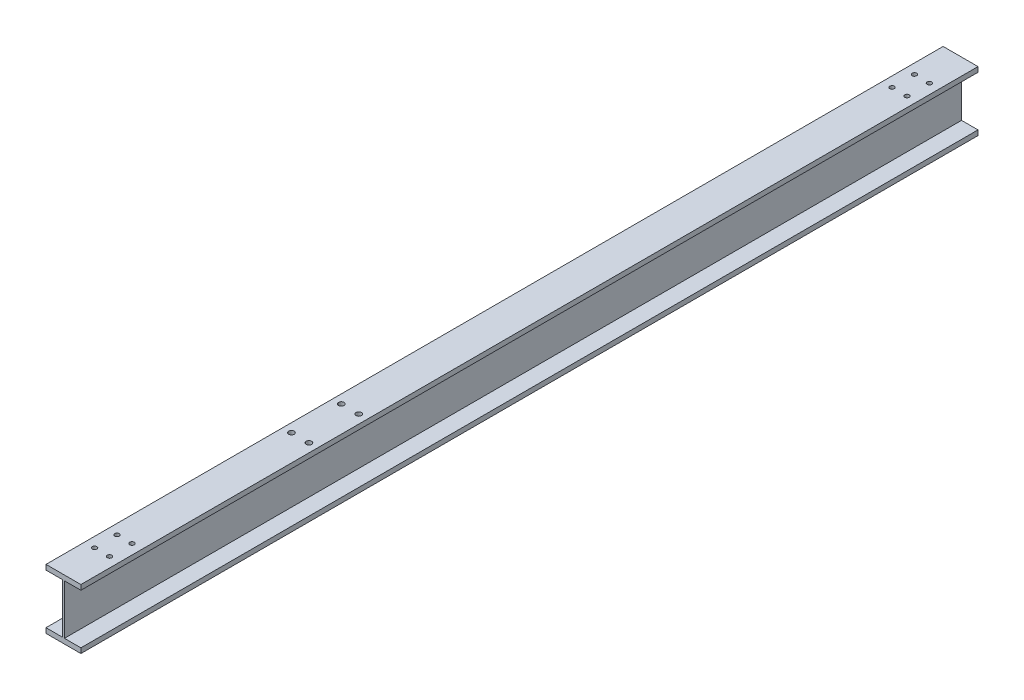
ISO-10303-21;
HEADER;
FILE_DESCRIPTION(('STEP AP214'),'2;1');
FILE_NAME('part.step','',(''),(''),'','','');
FILE_SCHEMA(('AUTOMOTIVE_DESIGN { 1 0 10303 214 1 1 1 1 }'));
ENDSEC;
DATA;
#1=APPLICATION_CONTEXT('core data for automotive mechanical design processes');
#2=APPLICATION_PROTOCOL_DEFINITION('international standard','automotive_design',2000,#1);
#3=PRODUCT_CONTEXT('',#1,'mechanical');
#4=PRODUCT('Part','Part','',(#3));
#5=PRODUCT_RELATED_PRODUCT_CATEGORY('part','',(#4));
#6=PRODUCT_DEFINITION_FORMATION('','',#4);
#7=PRODUCT_DEFINITION_CONTEXT('part definition',#1,'design');
#8=PRODUCT_DEFINITION('design','',#6,#7);
#9=PRODUCT_DEFINITION_SHAPE('','',#8);
#10=(LENGTH_UNIT() NAMED_UNIT(*) SI_UNIT(.MILLI.,.METRE.));
#11=(NAMED_UNIT(*) PLANE_ANGLE_UNIT() SI_UNIT($,.RADIAN.));
#12=(NAMED_UNIT(*) SI_UNIT($,.STERADIAN.) SOLID_ANGLE_UNIT());
#13=UNCERTAINTY_MEASURE_WITH_UNIT(LENGTH_MEASURE(1.E-05),#10,'distance_accuracy_value','');
#14=(GEOMETRIC_REPRESENTATION_CONTEXT(3) GLOBAL_UNCERTAINTY_ASSIGNED_CONTEXT((#13)) GLOBAL_UNIT_ASSIGNED_CONTEXT((#10,
#11,#12)) REPRESENTATION_CONTEXT('',''));
#15=CARTESIAN_POINT('',(0.,0.,0.));
#16=DIRECTION('',(0.,0.,1.));
#17=DIRECTION('',(1.,0.,0.));
#18=AXIS2_PLACEMENT_3D('',#15,#16,#17);
#19=CARTESIAN_POINT('',(-30.,95.,155.));
#20=DIRECTION('',(0.,1.,0.));
#21=DIRECTION('',(0.,0.,1.));
#22=AXIS2_PLACEMENT_3D('',#19,#20,#21);
#23=CYLINDRICAL_SURFACE('',#22,9.);
#24=DIRECTION('',(0.,1.,0.));
#25=VECTOR('',#24,1.);
#26=CARTESIAN_POINT('',(-30.,95.,164.));
#27=LINE('',#26,#25);
#28=CARTESIAN_POINT('',(-30.,100.,164.));
#29=VERTEX_POINT('',#28);
#30=CARTESIAN_POINT('',(-30.,120.,164.));
#31=VERTEX_POINT('',#30);
#32=EDGE_CURVE('E10',#29,#31,#27,.T.);
#33=ORIENTED_EDGE('',*,*,#32,.F.);
#34=CARTESIAN_POINT('',(-30.,100.,155.));
#35=DIRECTION('',(0.,1.,0.));
#36=DIRECTION('',(0.,0.,1.));
#37=AXIS2_PLACEMENT_3D('',#34,#35,#36);
#38=CIRCLE('',#37,9.);
#39=EDGE_CURVE('E380',#29,#29,#38,.T.);
#40=ORIENTED_EDGE('',*,*,#39,.F.);
#41=ORIENTED_EDGE('',*,*,#32,.T.);
#42=CARTESIAN_POINT('',(-30.,120.,155.));
#43=DIRECTION('',(0.,1.,0.));
#44=DIRECTION('',(0.,0.,1.));
#45=AXIS2_PLACEMENT_3D('',#42,#43,#44);
#46=CIRCLE('',#45,9.);
#47=EDGE_CURVE('E461',#31,#31,#46,.T.);
#48=ORIENTED_EDGE('',*,*,#47,.T.);
#49=EDGE_LOOP('',(#33,#40,#41,#48));
#50=FACE_BOUND('',#49,.T.);
#51=ADVANCED_FACE('F16',(#50),#23,.F.);
#52=CARTESIAN_POINT('',(-30.,95.,245.));
#53=DIRECTION('',(0.,1.,0.));
#54=DIRECTION('',(0.,0.,1.));
#55=AXIS2_PLACEMENT_3D('',#52,#53,#54);
#56=CYLINDRICAL_SURFACE('',#55,9.);
#57=DIRECTION('',(0.,1.,0.));
#58=VECTOR('',#57,1.);
#59=CARTESIAN_POINT('',(-30.,95.,254.));
#60=LINE('',#59,#58);
#61=CARTESIAN_POINT('',(-30.,100.,254.));
#62=VERTEX_POINT('',#61);
#63=CARTESIAN_POINT('',(-30.,120.,254.));
#64=VERTEX_POINT('',#63);
#65=EDGE_CURVE('E25',#62,#64,#60,.T.);
#66=ORIENTED_EDGE('',*,*,#65,.F.);
#67=CARTESIAN_POINT('',(-30.,100.,245.));
#68=DIRECTION('',(0.,1.,0.));
#69=DIRECTION('',(0.,0.,1.));
#70=AXIS2_PLACEMENT_3D('',#67,#68,#69);
#71=CIRCLE('',#70,9.);
#72=EDGE_CURVE('E414',#62,#62,#71,.T.);
#73=ORIENTED_EDGE('',*,*,#72,.F.);
#74=ORIENTED_EDGE('',*,*,#65,.T.);
#75=CARTESIAN_POINT('',(-30.,120.,245.));
#76=DIRECTION('',(0.,1.,0.));
#77=DIRECTION('',(0.,0.,1.));
#78=AXIS2_PLACEMENT_3D('',#75,#76,#77);
#79=CIRCLE('',#78,9.);
#80=EDGE_CURVE('E285',#64,#64,#79,.T.);
#81=ORIENTED_EDGE('',*,*,#80,.T.);
#82=EDGE_LOOP('',(#66,#73,#74,#81));
#83=FACE_BOUND('',#82,.T.);
#84=ADVANCED_FACE('F596',(#83),#56,.F.);
#85=CARTESIAN_POINT('',(-35.,99.,2450.));
#86=DIRECTION('',(0.,1.,0.));
#87=DIRECTION('',(0.,0.,1.));
#88=AXIS2_PLACEMENT_3D('',#85,#86,#87);
#89=CYLINDRICAL_SURFACE('',#88,11.);
#90=DIRECTION('',(0.,1.,0.));
#91=VECTOR('',#90,1.);
#92=CARTESIAN_POINT('',(-35.,99.,2461.));
#93=LINE('',#92,#91);
#94=CARTESIAN_POINT('',(-35.,100.,2461.));
#95=VERTEX_POINT('',#94);
#96=CARTESIAN_POINT('',(-35.,120.,2461.));
#97=VERTEX_POINT('',#96);
#98=EDGE_CURVE('E19',#95,#97,#93,.T.);
#99=ORIENTED_EDGE('',*,*,#98,.F.);
#100=CARTESIAN_POINT('',(-35.,100.,2450.));
#101=DIRECTION('',(0.,1.,0.));
#102=DIRECTION('',(0.,0.,1.));
#103=AXIS2_PLACEMENT_3D('',#100,#101,#102);
#104=CIRCLE('',#103,11.);
#105=EDGE_CURVE('E474',#95,#95,#104,.T.);
#106=ORIENTED_EDGE('',*,*,#105,.F.);
#107=ORIENTED_EDGE('',*,*,#98,.T.);
#108=CARTESIAN_POINT('',(-35.,120.,2450.));
#109=DIRECTION('',(0.,1.,0.));
#110=DIRECTION('',(0.,0.,1.));
#111=AXIS2_PLACEMENT_3D('',#108,#109,#110);
#112=CIRCLE('',#111,11.);
#113=EDGE_CURVE('E337',#97,#97,#112,.T.);
#114=ORIENTED_EDGE('',*,*,#113,.T.);
#115=EDGE_LOOP('',(#99,#106,#107,#114));
#116=FACE_BOUND('',#115,.T.);
#117=ADVANCED_FACE('F600',(#116),#89,.F.);
#118=CARTESIAN_POINT('',(-35.,99.,2650.));
#119=DIRECTION('',(0.,1.,0.));
#120=DIRECTION('',(0.,0.,1.));
#121=AXIS2_PLACEMENT_3D('',#118,#119,#120);
#122=CYLINDRICAL_SURFACE('',#121,11.);
#123=DIRECTION('',(0.,1.,0.));
#124=VECTOR('',#123,1.);
#125=CARTESIAN_POINT('',(-35.,99.,2661.));
#126=LINE('',#125,#124);
#127=CARTESIAN_POINT('',(-35.,100.,2661.));
#128=VERTEX_POINT('',#127);
#129=CARTESIAN_POINT('',(-35.,120.,2661.));
#130=VERTEX_POINT('',#129);
#131=EDGE_CURVE('E385',#128,#130,#126,.T.);
#132=ORIENTED_EDGE('',*,*,#131,.F.);
#133=CARTESIAN_POINT('',(-35.,100.,2650.));
#134=DIRECTION('',(0.,1.,0.));
#135=DIRECTION('',(0.,0.,1.));
#136=AXIS2_PLACEMENT_3D('',#133,#134,#135);
#137=CIRCLE('',#136,11.);
#138=EDGE_CURVE('E470',#128,#128,#137,.T.);
#139=ORIENTED_EDGE('',*,*,#138,.F.);
#140=ORIENTED_EDGE('',*,*,#131,.T.);
#141=CARTESIAN_POINT('',(-35.,120.,2650.));
#142=DIRECTION('',(0.,1.,0.));
#143=DIRECTION('',(0.,0.,1.));
#144=AXIS2_PLACEMENT_3D('',#141,#142,#143);
#145=CIRCLE('',#144,11.);
#146=EDGE_CURVE('E333',#130,#130,#145,.T.);
#147=ORIENTED_EDGE('',*,*,#146,.T.);
#148=EDGE_LOOP('',(#132,#139,#140,#147));
#149=FACE_BOUND('',#148,.T.);
#150=ADVANCED_FACE('F604',(#149),#122,.F.);
#151=CARTESIAN_POINT('',(-30.,95.,3355.));
#152=DIRECTION('',(0.,1.,0.));
#153=DIRECTION('',(0.,0.,1.));
#154=AXIS2_PLACEMENT_3D('',#151,#152,#153);
#155=CYLINDRICAL_SURFACE('',#154,9.);
#156=DIRECTION('',(0.,1.,0.));
#157=VECTOR('',#156,1.);
#158=CARTESIAN_POINT('',(-30.,95.,3364.));
#159=LINE('',#158,#157);
#160=CARTESIAN_POINT('',(-30.,100.,3364.));
#161=VERTEX_POINT('',#160);
#162=CARTESIAN_POINT('',(-30.,120.,3364.));
#163=VERTEX_POINT('',#162);
#164=EDGE_CURVE('E327',#161,#163,#159,.T.);
#165=ORIENTED_EDGE('',*,*,#164,.F.);
#166=CARTESIAN_POINT('',(-30.,100.,3355.));
#167=DIRECTION('',(0.,1.,0.));
#168=DIRECTION('',(0.,0.,1.));
#169=AXIS2_PLACEMENT_3D('',#166,#167,#168);
#170=CIRCLE('',#169,9.);
#171=EDGE_CURVE('E410',#161,#161,#170,.T.);
#172=ORIENTED_EDGE('',*,*,#171,.F.);
#173=ORIENTED_EDGE('',*,*,#164,.T.);
#174=CARTESIAN_POINT('',(-30.,120.,3355.));
#175=DIRECTION('',(0.,1.,0.));
#176=DIRECTION('',(0.,0.,1.));
#177=AXIS2_PLACEMENT_3D('',#174,#175,#176);
#178=CIRCLE('',#177,9.);
#179=EDGE_CURVE('E338',#163,#163,#178,.T.);
#180=ORIENTED_EDGE('',*,*,#179,.T.);
#181=EDGE_LOOP('',(#165,#172,#173,#180));
#182=FACE_BOUND('',#181,.T.);
#183=ADVANCED_FACE('F497',(#182),#155,.F.);
#184=CARTESIAN_POINT('',(-30.,95.,3445.));
#185=DIRECTION('',(0.,1.,0.));
#186=DIRECTION('',(0.,0.,1.));
#187=AXIS2_PLACEMENT_3D('',#184,#185,#186);
#188=CYLINDRICAL_SURFACE('',#187,9.);
#189=DIRECTION('',(0.,1.,0.));
#190=VECTOR('',#189,1.);
#191=CARTESIAN_POINT('',(-30.,95.,3454.));
#192=LINE('',#191,#190);
#193=CARTESIAN_POINT('',(-30.,100.,3454.));
#194=VERTEX_POINT('',#193);
#195=CARTESIAN_POINT('',(-30.,120.,3454.));
#196=VERTEX_POINT('',#195);
#197=EDGE_CURVE('E324',#194,#196,#192,.T.);
#198=ORIENTED_EDGE('',*,*,#197,.F.);
#199=CARTESIAN_POINT('',(-30.,100.,3445.));
#200=DIRECTION('',(0.,1.,0.));
#201=DIRECTION('',(0.,0.,1.));
#202=AXIS2_PLACEMENT_3D('',#199,#200,#201);
#203=CIRCLE('',#202,9.);
#204=EDGE_CURVE('E415',#194,#194,#203,.T.);
#205=ORIENTED_EDGE('',*,*,#204,.F.);
#206=ORIENTED_EDGE('',*,*,#197,.T.);
#207=CARTESIAN_POINT('',(-30.,120.,3445.));
#208=DIRECTION('',(0.,1.,0.));
#209=DIRECTION('',(0.,0.,1.));
#210=AXIS2_PLACEMENT_3D('',#207,#208,#209);
#211=CIRCLE('',#210,9.);
#212=EDGE_CURVE('E441',#196,#196,#211,.T.);
#213=ORIENTED_EDGE('',*,*,#212,.T.);
#214=EDGE_LOOP('',(#198,#205,#206,#213));
#215=FACE_BOUND('',#214,.T.);
#216=ADVANCED_FACE('F613',(#215),#188,.F.);
#217=CARTESIAN_POINT('',(30.,95.,155.));
#218=DIRECTION('',(0.,1.,0.));
#219=DIRECTION('',(0.,0.,1.));
#220=AXIS2_PLACEMENT_3D('',#217,#218,#219);
#221=CYLINDRICAL_SURFACE('',#220,9.);
#222=DIRECTION('',(0.,1.,0.));
#223=VECTOR('',#222,1.);
#224=CARTESIAN_POINT('',(30.,95.,164.));
#225=LINE('',#224,#223);
#226=CARTESIAN_POINT('',(30.,100.,164.));
#227=VERTEX_POINT('',#226);
#228=CARTESIAN_POINT('',(30.,120.,164.));
#229=VERTEX_POINT('',#228);
#230=EDGE_CURVE('E328',#227,#229,#225,.T.);
#231=ORIENTED_EDGE('',*,*,#230,.F.);
#232=CARTESIAN_POINT('',(30.,100.,155.));
#233=DIRECTION('',(0.,1.,0.));
#234=DIRECTION('',(0.,0.,1.));
#235=AXIS2_PLACEMENT_3D('',#232,#233,#234);
#236=CIRCLE('',#235,9.);
#237=EDGE_CURVE('E371',#227,#227,#236,.T.);
#238=ORIENTED_EDGE('',*,*,#237,.F.);
#239=ORIENTED_EDGE('',*,*,#230,.T.);
#240=CARTESIAN_POINT('',(30.,120.,155.));
#241=DIRECTION('',(0.,1.,0.));
#242=DIRECTION('',(0.,0.,1.));
#243=AXIS2_PLACEMENT_3D('',#240,#241,#242);
#244=CIRCLE('',#243,9.);
#245=EDGE_CURVE('E281',#229,#229,#244,.T.);
#246=ORIENTED_EDGE('',*,*,#245,.T.);
#247=EDGE_LOOP('',(#231,#238,#239,#246));
#248=FACE_BOUND('',#247,.T.);
#249=ADVANCED_FACE('F616',(#248),#221,.F.);
#250=CARTESIAN_POINT('',(30.,95.,245.));
#251=DIRECTION('',(0.,1.,0.));
#252=DIRECTION('',(0.,0.,1.));
#253=AXIS2_PLACEMENT_3D('',#250,#251,#252);
#254=CYLINDRICAL_SURFACE('',#253,9.);
#255=DIRECTION('',(0.,1.,0.));
#256=VECTOR('',#255,1.);
#257=CARTESIAN_POINT('',(30.,95.,254.));
#258=LINE('',#257,#256);
#259=CARTESIAN_POINT('',(30.,100.,254.));
#260=VERTEX_POINT('',#259);
#261=CARTESIAN_POINT('',(30.,120.,254.));
#262=VERTEX_POINT('',#261);
#263=EDGE_CURVE('E448',#260,#262,#258,.T.);
#264=ORIENTED_EDGE('',*,*,#263,.F.);
#265=CARTESIAN_POINT('',(30.,100.,245.));
#266=DIRECTION('',(0.,1.,0.));
#267=DIRECTION('',(0.,0.,1.));
#268=AXIS2_PLACEMENT_3D('',#265,#266,#267);
#269=CIRCLE('',#268,9.);
#270=EDGE_CURVE('E419',#260,#260,#269,.T.);
#271=ORIENTED_EDGE('',*,*,#270,.F.);
#272=ORIENTED_EDGE('',*,*,#263,.T.);
#273=CARTESIAN_POINT('',(30.,120.,245.));
#274=DIRECTION('',(0.,1.,0.));
#275=DIRECTION('',(0.,0.,1.));
#276=AXIS2_PLACEMENT_3D('',#273,#274,#275);
#277=CIRCLE('',#276,9.);
#278=EDGE_CURVE('E286',#262,#262,#277,.T.);
#279=ORIENTED_EDGE('',*,*,#278,.T.);
#280=EDGE_LOOP('',(#264,#271,#272,#279));
#281=FACE_BOUND('',#280,.T.);
#282=ADVANCED_FACE('F541',(#281),#254,.F.);
#283=CARTESIAN_POINT('',(35.,99.,2450.));
#284=DIRECTION('',(0.,1.,0.));
#285=DIRECTION('',(0.,0.,1.));
#286=AXIS2_PLACEMENT_3D('',#283,#284,#285);
#287=CYLINDRICAL_SURFACE('',#286,11.);
#288=DIRECTION('',(0.,1.,0.));
#289=VECTOR('',#288,1.);
#290=CARTESIAN_POINT('',(35.,99.,2461.));
#291=LINE('',#290,#289);
#292=CARTESIAN_POINT('',(35.,100.,2461.));
#293=VERTEX_POINT('',#292);
#294=CARTESIAN_POINT('',(35.,120.,2461.));
#295=VERTEX_POINT('',#294);
#296=EDGE_CURVE('E445',#293,#295,#291,.T.);
#297=ORIENTED_EDGE('',*,*,#296,.F.);
#298=CARTESIAN_POINT('',(35.,100.,2450.));
#299=DIRECTION('',(0.,1.,0.));
#300=DIRECTION('',(0.,0.,1.));
#301=AXIS2_PLACEMENT_3D('',#298,#299,#300);
#302=CIRCLE('',#301,11.);
#303=EDGE_CURVE('E409',#293,#293,#302,.T.);
#304=ORIENTED_EDGE('',*,*,#303,.F.);
#305=ORIENTED_EDGE('',*,*,#296,.T.);
#306=CARTESIAN_POINT('',(35.,120.,2450.));
#307=DIRECTION('',(0.,1.,0.));
#308=DIRECTION('',(0.,0.,1.));
#309=AXIS2_PLACEMENT_3D('',#306,#307,#308);
#310=CIRCLE('',#309,11.);
#311=EDGE_CURVE('E437',#295,#295,#310,.T.);
#312=ORIENTED_EDGE('',*,*,#311,.T.);
#313=EDGE_LOOP('',(#297,#304,#305,#312));
#314=FACE_BOUND('',#313,.T.);
#315=ADVANCED_FACE('F623',(#314),#287,.F.);
#316=CARTESIAN_POINT('',(35.,99.,2650.));
#317=DIRECTION('',(0.,1.,0.));
#318=DIRECTION('',(0.,0.,1.));
#319=AXIS2_PLACEMENT_3D('',#316,#317,#318);
#320=CYLINDRICAL_SURFACE('',#319,11.);
#321=DIRECTION('',(0.,1.,0.));
#322=VECTOR('',#321,1.);
#323=CARTESIAN_POINT('',(35.,99.,2661.));
#324=LINE('',#323,#322);
#325=CARTESIAN_POINT('',(35.,100.,2661.));
#326=VERTEX_POINT('',#325);
#327=CARTESIAN_POINT('',(35.,120.,2661.));
#328=VERTEX_POINT('',#327);
#329=EDGE_CURVE('E449',#326,#328,#324,.T.);
#330=ORIENTED_EDGE('',*,*,#329,.F.);
#331=CARTESIAN_POINT('',(35.,100.,2650.));
#332=DIRECTION('',(0.,1.,0.));
#333=DIRECTION('',(0.,0.,1.));
#334=AXIS2_PLACEMENT_3D('',#331,#332,#333);
#335=CIRCLE('',#334,11.);
#336=EDGE_CURVE('E405',#326,#326,#335,.T.);
#337=ORIENTED_EDGE('',*,*,#336,.F.);
#338=ORIENTED_EDGE('',*,*,#329,.T.);
#339=CARTESIAN_POINT('',(35.,120.,2650.));
#340=DIRECTION('',(0.,1.,0.));
#341=DIRECTION('',(0.,0.,1.));
#342=AXIS2_PLACEMENT_3D('',#339,#340,#341);
#343=CIRCLE('',#342,11.);
#344=EDGE_CURVE('E433',#328,#328,#343,.T.);
#345=ORIENTED_EDGE('',*,*,#344,.T.);
#346=EDGE_LOOP('',(#330,#337,#338,#345));
#347=FACE_BOUND('',#346,.T.);
#348=ADVANCED_FACE('F626',(#347),#320,.F.);
#349=CARTESIAN_POINT('',(30.,95.,3355.));
#350=DIRECTION('',(0.,1.,0.));
#351=DIRECTION('',(0.,0.,1.));
#352=AXIS2_PLACEMENT_3D('',#349,#350,#351);
#353=CYLINDRICAL_SURFACE('',#352,9.);
#354=DIRECTION('',(0.,1.,0.));
#355=VECTOR('',#354,1.);
#356=CARTESIAN_POINT('',(30.,95.,3364.));
#357=LINE('',#356,#355);
#358=CARTESIAN_POINT('',(30.,100.,3364.));
#359=VERTEX_POINT('',#358);
#360=CARTESIAN_POINT('',(30.,120.,3364.));
#361=VERTEX_POINT('',#360);
#362=EDGE_CURVE('E379',#359,#361,#357,.T.);
#363=ORIENTED_EDGE('',*,*,#362,.F.);
#364=CARTESIAN_POINT('',(30.,100.,3355.));
#365=DIRECTION('',(0.,1.,0.));
#366=DIRECTION('',(0.,0.,1.));
#367=AXIS2_PLACEMENT_3D('',#364,#365,#366);
#368=CIRCLE('',#367,9.);
#369=EDGE_CURVE('E314',#359,#359,#368,.T.);
#370=ORIENTED_EDGE('',*,*,#369,.F.);
#371=ORIENTED_EDGE('',*,*,#362,.T.);
#372=CARTESIAN_POINT('',(30.,120.,3355.));
#373=DIRECTION('',(0.,1.,0.));
#374=DIRECTION('',(0.,0.,1.));
#375=AXIS2_PLACEMENT_3D('',#372,#373,#374);
#376=CIRCLE('',#375,9.);
#377=EDGE_CURVE('E429',#361,#361,#376,.T.);
#378=ORIENTED_EDGE('',*,*,#377,.T.);
#379=EDGE_LOOP('',(#363,#370,#371,#378));
#380=FACE_BOUND('',#379,.T.);
#381=ADVANCED_FACE('F630',(#380),#353,.F.);
#382=CARTESIAN_POINT('',(30.,95.,3445.));
#383=DIRECTION('',(0.,1.,0.));
#384=DIRECTION('',(0.,0.,1.));
#385=AXIS2_PLACEMENT_3D('',#382,#383,#384);
#386=CYLINDRICAL_SURFACE('',#385,9.);
#387=DIRECTION('',(0.,1.,0.));
#388=VECTOR('',#387,1.);
#389=CARTESIAN_POINT('',(30.,95.,3454.));
#390=LINE('',#389,#388);
#391=CARTESIAN_POINT('',(30.,100.,3454.));
#392=VERTEX_POINT('',#391);
#393=CARTESIAN_POINT('',(30.,120.,3454.));
#394=VERTEX_POINT('',#393);
#395=EDGE_CURVE('E376',#392,#394,#390,.T.);
#396=ORIENTED_EDGE('',*,*,#395,.F.);
#397=CARTESIAN_POINT('',(30.,100.,3445.));
#398=DIRECTION('',(0.,1.,0.));
#399=DIRECTION('',(0.,0.,1.));
#400=AXIS2_PLACEMENT_3D('',#397,#398,#399);
#401=CIRCLE('',#400,9.);
#402=EDGE_CURVE('E310',#392,#392,#401,.T.);
#403=ORIENTED_EDGE('',*,*,#402,.F.);
#404=ORIENTED_EDGE('',*,*,#395,.T.);
#405=CARTESIAN_POINT('',(30.,120.,3445.));
#406=DIRECTION('',(0.,1.,0.));
#407=DIRECTION('',(0.,0.,1.));
#408=AXIS2_PLACEMENT_3D('',#405,#406,#407);
#409=CIRCLE('',#408,9.);
#410=EDGE_CURVE('E425',#394,#394,#409,.T.);
#411=ORIENTED_EDGE('',*,*,#410,.T.);
#412=EDGE_LOOP('',(#396,#403,#404,#411));
#413=FACE_BOUND('',#412,.T.);
#414=ADVANCED_FACE('F565',(#413),#386,.F.);
#415=CARTESIAN_POINT('',(-4.,100.,0.));
#416=DIRECTION('',(1.,0.,0.));
#417=DIRECTION('',(0.,1.,0.));
#418=AXIS2_PLACEMENT_3D('',#415,#416,#417);
#419=PLANE('',#418);
#420=DIRECTION('',(0.,-1.,0.));
#421=VECTOR('',#420,1.);
#422=CARTESIAN_POINT('',(-4.,100.,0.));
#423=LINE('',#422,#421);
#424=CARTESIAN_POINT('',(-4.,100.,0.));
#425=VERTEX_POINT('',#424);
#426=CARTESIAN_POINT('',(-4.,-100.,0.));
#427=VERTEX_POINT('',#426);
#428=EDGE_CURVE('E276',#425,#427,#423,.T.);
#429=ORIENTED_EDGE('',*,*,#428,.T.);
#430=DIRECTION('',(0.,0.,1.));
#431=VECTOR('',#430,1.);
#432=CARTESIAN_POINT('',(-4.,-100.,0.));
#433=LINE('',#432,#431);
#434=CARTESIAN_POINT('',(-4.,-100.,3600.));
#435=VERTEX_POINT('',#434);
#436=EDGE_CURVE('E301',#427,#435,#433,.T.);
#437=ORIENTED_EDGE('',*,*,#436,.T.);
#438=DIRECTION('',(0.,-1.,0.));
#439=VECTOR('',#438,1.);
#440=CARTESIAN_POINT('',(-4.,100.,3600.));
#441=LINE('',#440,#439);
#442=CARTESIAN_POINT('',(-4.,100.,3600.));
#443=VERTEX_POINT('',#442);
#444=EDGE_CURVE('E384',#443,#435,#441,.T.);
#445=ORIENTED_EDGE('',*,*,#444,.F.);
#446=DIRECTION('',(0.,0.,1.));
#447=VECTOR('',#446,1.);
#448=CARTESIAN_POINT('',(-4.,100.,0.));
#449=LINE('',#448,#447);
#450=EDGE_CURVE('E467',#425,#443,#449,.T.);
#451=ORIENTED_EDGE('',*,*,#450,.F.);
#452=EDGE_LOOP('',(#429,#437,#445,#451));
#453=FACE_BOUND('',#452,.T.);
#454=ADVANCED_FACE('F504',(#453),#419,.F.);
#455=CARTESIAN_POINT('',(-70.,100.,0.));
#456=DIRECTION('',(0.,1.,0.));
#457=DIRECTION('',(1.,0.,0.));
#458=AXIS2_PLACEMENT_3D('',#455,#456,#457);
#459=PLANE('',#458);
#460=ORIENTED_EDGE('',*,*,#39,.T.);
#461=EDGE_LOOP('',(#460));
#462=FACE_BOUND('',#461,.T.);
#463=ORIENTED_EDGE('',*,*,#72,.T.);
#464=EDGE_LOOP('',(#463));
#465=FACE_BOUND('',#464,.T.);
#466=ORIENTED_EDGE('',*,*,#171,.T.);
#467=EDGE_LOOP('',(#466));
#468=FACE_BOUND('',#467,.T.);
#469=ORIENTED_EDGE('',*,*,#204,.T.);
#470=EDGE_LOOP('',(#469));
#471=FACE_BOUND('',#470,.T.);
#472=ORIENTED_EDGE('',*,*,#105,.T.);
#473=EDGE_LOOP('',(#472));
#474=FACE_BOUND('',#473,.T.);
#475=ORIENTED_EDGE('',*,*,#138,.T.);
#476=EDGE_LOOP('',(#475));
#477=FACE_BOUND('',#476,.T.);
#478=DIRECTION('',(1.,0.,0.));
#479=VECTOR('',#478,1.);
#480=CARTESIAN_POINT('',(-70.,100.,0.));
#481=LINE('',#480,#479);
#482=CARTESIAN_POINT('',(-70.,100.,0.));
#483=VERTEX_POINT('',#482);
#484=EDGE_CURVE('E271',#483,#425,#481,.T.);
#485=ORIENTED_EDGE('',*,*,#484,.T.);
#486=ORIENTED_EDGE('',*,*,#450,.T.);
#487=DIRECTION('',(1.,0.,0.));
#488=VECTOR('',#487,1.);
#489=CARTESIAN_POINT('',(-70.,100.,3600.));
#490=LINE('',#489,#488);
#491=CARTESIAN_POINT('',(-70.,100.,3600.));
#492=VERTEX_POINT('',#491);
#493=EDGE_CURVE('E375',#492,#443,#490,.T.);
#494=ORIENTED_EDGE('',*,*,#493,.F.);
#495=DIRECTION('',(0.,0.,1.));
#496=VECTOR('',#495,1.);
#497=CARTESIAN_POINT('',(-70.,100.,0.));
#498=LINE('',#497,#496);
#499=EDGE_CURVE('E464',#483,#492,#498,.T.);
#500=ORIENTED_EDGE('',*,*,#499,.F.);
#501=EDGE_LOOP('',(#485,#486,#494,#500));
#502=FACE_BOUND('',#501,.T.);
#503=ADVANCED_FACE('F500',(#462,#465,#468,#471,#474,#477,#502),#459,.F.);
#504=CARTESIAN_POINT('',(-70.,120.,0.));
#505=DIRECTION('',(1.,0.,0.));
#506=DIRECTION('',(0.,1.,0.));
#507=AXIS2_PLACEMENT_3D('',#504,#505,#506);
#508=PLANE('',#507);
#509=DIRECTION('',(0.,-1.,0.));
#510=VECTOR('',#509,1.);
#511=CARTESIAN_POINT('',(-70.,120.,0.));
#512=LINE('',#511,#510);
#513=CARTESIAN_POINT('',(-70.,120.,0.));
#514=VERTEX_POINT('',#513);
#515=EDGE_CURVE('E275',#514,#483,#512,.T.);
#516=ORIENTED_EDGE('',*,*,#515,.T.);
#517=ORIENTED_EDGE('',*,*,#499,.T.);
#518=DIRECTION('',(0.,-1.,0.));
#519=VECTOR('',#518,1.);
#520=CARTESIAN_POINT('',(-70.,120.,3600.));
#521=LINE('',#520,#519);
#522=CARTESIAN_POINT('',(-70.,120.,3600.));
#523=VERTEX_POINT('',#522);
#524=EDGE_CURVE('E366',#523,#492,#521,.T.);
#525=ORIENTED_EDGE('',*,*,#524,.F.);
#526=DIRECTION('',(0.,0.,1.));
#527=VECTOR('',#526,1.);
#528=CARTESIAN_POINT('',(-70.,120.,0.));
#529=LINE('',#528,#527);
#530=EDGE_CURVE('E370',#514,#523,#529,.T.);
#531=ORIENTED_EDGE('',*,*,#530,.F.);
#532=EDGE_LOOP('',(#516,#517,#525,#531));
#533=FACE_BOUND('',#532,.T.);
#534=ADVANCED_FACE('F503',(#533),#508,.F.);
#535=CARTESIAN_POINT('',(70.,120.,0.));
#536=DIRECTION('',(0.,-1.,0.));
#537=DIRECTION('',(0.,0.,-1.));
#538=AXIS2_PLACEMENT_3D('',#535,#536,#537);
#539=PLANE('',#538);
#540=ORIENTED_EDGE('',*,*,#47,.F.);
#541=EDGE_LOOP('',(#540));
#542=FACE_BOUND('',#541,.T.);
#543=ORIENTED_EDGE('',*,*,#80,.F.);
#544=EDGE_LOOP('',(#543));
#545=FACE_BOUND('',#544,.T.);
#546=ORIENTED_EDGE('',*,*,#245,.F.);
#547=EDGE_LOOP('',(#546));
#548=FACE_BOUND('',#547,.T.);
#549=ORIENTED_EDGE('',*,*,#278,.F.);
#550=EDGE_LOOP('',(#549));
#551=FACE_BOUND('',#550,.T.);
#552=ORIENTED_EDGE('',*,*,#113,.F.);
#553=EDGE_LOOP('',(#552));
#554=FACE_BOUND('',#553,.T.);
#555=ORIENTED_EDGE('',*,*,#146,.F.);
#556=EDGE_LOOP('',(#555));
#557=FACE_BOUND('',#556,.T.);
#558=ORIENTED_EDGE('',*,*,#179,.F.);
#559=EDGE_LOOP('',(#558));
#560=FACE_BOUND('',#559,.T.);
#561=ORIENTED_EDGE('',*,*,#212,.F.);
#562=EDGE_LOOP('',(#561));
#563=FACE_BOUND('',#562,.T.);
#564=ORIENTED_EDGE('',*,*,#311,.F.);
#565=EDGE_LOOP('',(#564));
#566=FACE_BOUND('',#565,.T.);
#567=ORIENTED_EDGE('',*,*,#344,.F.);
#568=EDGE_LOOP('',(#567));
#569=FACE_BOUND('',#568,.T.);
#570=ORIENTED_EDGE('',*,*,#377,.F.);
#571=EDGE_LOOP('',(#570));
#572=FACE_BOUND('',#571,.T.);
#573=ORIENTED_EDGE('',*,*,#410,.F.);
#574=EDGE_LOOP('',(#573));
#575=FACE_BOUND('',#574,.T.);
#576=DIRECTION('',(-1.,0.,0.));
#577=VECTOR('',#576,1.);
#578=CARTESIAN_POINT('',(70.,120.,0.));
#579=LINE('',#578,#577);
#580=CARTESIAN_POINT('',(70.,120.,0.));
#581=VERTEX_POINT('',#580);
#582=EDGE_CURVE('E268',#581,#514,#579,.T.);
#583=ORIENTED_EDGE('',*,*,#582,.T.);
#584=ORIENTED_EDGE('',*,*,#530,.T.);
#585=DIRECTION('',(-1.,0.,0.));
#586=VECTOR('',#585,1.);
#587=CARTESIAN_POINT('',(70.,120.,3600.));
#588=LINE('',#587,#586);
#589=CARTESIAN_POINT('',(70.,120.,3600.));
#590=VERTEX_POINT('',#589);
#591=EDGE_CURVE('E362',#590,#523,#588,.T.);
#592=ORIENTED_EDGE('',*,*,#591,.F.);
#593=DIRECTION('',(0.,0.,1.));
#594=VECTOR('',#593,1.);
#595=CARTESIAN_POINT('',(70.,120.,0.));
#596=LINE('',#595,#594);
#597=EDGE_CURVE('E367',#581,#590,#596,.T.);
#598=ORIENTED_EDGE('',*,*,#597,.F.);
#599=EDGE_LOOP('',(#583,#584,#592,#598));
#600=FACE_BOUND('',#599,.T.);
#601=ADVANCED_FACE('F544',(#542,#545,#548,#551,#554,#557,#560,#563,#566,#569,#572,#575,#600),
#539,.F.);
#602=CARTESIAN_POINT('',(70.,100.,0.));
#603=DIRECTION('',(-1.,0.,0.));
#604=DIRECTION('',(0.,0.,1.));
#605=AXIS2_PLACEMENT_3D('',#602,#603,#604);
#606=PLANE('',#605);
#607=DIRECTION('',(0.,1.,0.));
#608=VECTOR('',#607,1.);
#609=CARTESIAN_POINT('',(70.,100.,0.));
#610=LINE('',#609,#608);
#611=CARTESIAN_POINT('',(70.,100.,0.));
#612=VERTEX_POINT('',#611);
#613=EDGE_CURVE('E287',#612,#581,#610,.T.);
#614=ORIENTED_EDGE('',*,*,#613,.T.);
#615=ORIENTED_EDGE('',*,*,#597,.T.);
#616=DIRECTION('',(0.,1.,0.));
#617=VECTOR('',#616,1.);
#618=CARTESIAN_POINT('',(70.,100.,3600.));
#619=LINE('',#618,#617);
#620=CARTESIAN_POINT('',(70.,100.,3600.));
#621=VERTEX_POINT('',#620);
#622=EDGE_CURVE('E358',#621,#590,#619,.T.);
#623=ORIENTED_EDGE('',*,*,#622,.F.);
#624=DIRECTION('',(0.,0.,1.));
#625=VECTOR('',#624,1.);
#626=CARTESIAN_POINT('',(70.,100.,0.));
#627=LINE('',#626,#625);
#628=EDGE_CURVE('E315',#612,#621,#627,.T.);
#629=ORIENTED_EDGE('',*,*,#628,.F.);
#630=EDGE_LOOP('',(#614,#615,#623,#629));
#631=FACE_BOUND('',#630,.T.);
#632=ADVANCED_FACE('F547',(#631),#606,.F.);
#633=CARTESIAN_POINT('',(4.,100.,0.));
#634=DIRECTION('',(0.,1.,0.));
#635=DIRECTION('',(1.,0.,0.));
#636=AXIS2_PLACEMENT_3D('',#633,#634,#635);
#637=PLANE('',#636);
#638=ORIENTED_EDGE('',*,*,#237,.T.);
#639=EDGE_LOOP('',(#638));
#640=FACE_BOUND('',#639,.T.);
#641=ORIENTED_EDGE('',*,*,#270,.T.);
#642=EDGE_LOOP('',(#641));
#643=FACE_BOUND('',#642,.T.);
#644=ORIENTED_EDGE('',*,*,#303,.T.);
#645=EDGE_LOOP('',(#644));
#646=FACE_BOUND('',#645,.T.);
#647=ORIENTED_EDGE('',*,*,#336,.T.);
#648=EDGE_LOOP('',(#647));
#649=FACE_BOUND('',#648,.T.);
#650=ORIENTED_EDGE('',*,*,#369,.T.);
#651=EDGE_LOOP('',(#650));
#652=FACE_BOUND('',#651,.T.);
#653=ORIENTED_EDGE('',*,*,#402,.T.);
#654=EDGE_LOOP('',(#653));
#655=FACE_BOUND('',#654,.T.);
#656=DIRECTION('',(1.,0.,0.));
#657=VECTOR('',#656,1.);
#658=CARTESIAN_POINT('',(4.,100.,0.));
#659=LINE('',#658,#657);
#660=CARTESIAN_POINT('',(4.,100.,0.));
#661=VERTEX_POINT('',#660);
#662=EDGE_CURVE('E291',#661,#612,#659,.T.);
#663=ORIENTED_EDGE('',*,*,#662,.T.);
#664=ORIENTED_EDGE('',*,*,#628,.T.);
#665=DIRECTION('',(1.,0.,0.));
#666=VECTOR('',#665,1.);
#667=CARTESIAN_POINT('',(4.,100.,3600.));
#668=LINE('',#667,#666);
#669=CARTESIAN_POINT('',(4.,100.,3600.));
#670=VERTEX_POINT('',#669);
#671=EDGE_CURVE('E354',#670,#621,#668,.T.);
#672=ORIENTED_EDGE('',*,*,#671,.F.);
#673=DIRECTION('',(0.,0.,1.));
#674=VECTOR('',#673,1.);
#675=CARTESIAN_POINT('',(4.,100.,0.));
#676=LINE('',#675,#674);
#677=EDGE_CURVE('E300',#661,#670,#676,.T.);
#678=ORIENTED_EDGE('',*,*,#677,.F.);
#679=EDGE_LOOP('',(#663,#664,#672,#678));
#680=FACE_BOUND('',#679,.T.);
#681=ADVANCED_FACE('F538',(#640,#643,#646,#649,#652,#655,#680),#637,.F.);
#682=CARTESIAN_POINT('',(4.,-100.,0.));
#683=DIRECTION('',(-1.,0.,0.));
#684=DIRECTION('',(0.,0.,1.));
#685=AXIS2_PLACEMENT_3D('',#682,#683,#684);
#686=PLANE('',#685);
#687=DIRECTION('',(0.,1.,0.));
#688=VECTOR('',#687,1.);
#689=CARTESIAN_POINT('',(4.,-100.,0.));
#690=LINE('',#689,#688);
#691=CARTESIAN_POINT('',(4.,-100.,0.));
#692=VERTEX_POINT('',#691);
#693=EDGE_CURVE('E332',#692,#661,#690,.T.);
#694=ORIENTED_EDGE('',*,*,#693,.T.);
#695=ORIENTED_EDGE('',*,*,#677,.T.);
#696=DIRECTION('',(0.,1.,0.));
#697=VECTOR('',#696,1.);
#698=CARTESIAN_POINT('',(4.,-100.,3600.));
#699=LINE('',#698,#697);
#700=CARTESIAN_POINT('',(4.,-100.,3600.));
#701=VERTEX_POINT('',#700);
#702=EDGE_CURVE('E350',#701,#670,#699,.T.);
#703=ORIENTED_EDGE('',*,*,#702,.F.);
#704=DIRECTION('',(0.,0.,1.));
#705=VECTOR('',#704,1.);
#706=CARTESIAN_POINT('',(4.,-100.,0.));
#707=LINE('',#706,#705);
#708=EDGE_CURVE('E297',#692,#701,#707,.T.);
#709=ORIENTED_EDGE('',*,*,#708,.F.);
#710=EDGE_LOOP('',(#694,#695,#703,#709));
#711=FACE_BOUND('',#710,.T.);
#712=ADVANCED_FACE('F570',(#711),#686,.F.);
#713=CARTESIAN_POINT('',(70.,-100.,0.));
#714=DIRECTION('',(0.,-1.,0.));
#715=DIRECTION('',(0.,0.,-1.));
#716=AXIS2_PLACEMENT_3D('',#713,#714,#715);
#717=PLANE('',#716);
#718=DIRECTION('',(-1.,0.,0.));
#719=VECTOR('',#718,1.);
#720=CARTESIAN_POINT('',(70.,-100.,0.));
#721=LINE('',#720,#719);
#722=CARTESIAN_POINT('',(70.,-100.,0.));
#723=VERTEX_POINT('',#722);
#724=EDGE_CURVE('E342',#723,#692,#721,.T.);
#725=ORIENTED_EDGE('',*,*,#724,.T.);
#726=ORIENTED_EDGE('',*,*,#708,.T.);
#727=DIRECTION('',(-1.,0.,0.));
#728=VECTOR('',#727,1.);
#729=CARTESIAN_POINT('',(70.,-100.,3600.));
#730=LINE('',#729,#728);
#731=CARTESIAN_POINT('',(70.,-100.,3600.));
#732=VERTEX_POINT('',#731);
#733=EDGE_CURVE('E346',#732,#701,#730,.T.);
#734=ORIENTED_EDGE('',*,*,#733,.F.);
#735=DIRECTION('',(0.,0.,1.));
#736=VECTOR('',#735,1.);
#737=CARTESIAN_POINT('',(70.,-100.,0.));
#738=LINE('',#737,#736);
#739=EDGE_CURVE('E304',#723,#732,#738,.T.);
#740=ORIENTED_EDGE('',*,*,#739,.F.);
#741=EDGE_LOOP('',(#725,#726,#734,#740));
#742=FACE_BOUND('',#741,.T.);
#743=ADVANCED_FACE('F580',(#742),#717,.F.);
#744=CARTESIAN_POINT('',(-4.,-100.,0.));
#745=DIRECTION('',(0.,-1.,0.));
#746=DIRECTION('',(0.,0.,-1.));
#747=AXIS2_PLACEMENT_3D('',#744,#745,#746);
#748=PLANE('',#747);
#749=DIRECTION('',(-1.,0.,0.));
#750=VECTOR('',#749,1.);
#751=CARTESIAN_POINT('',(-4.,-100.,0.));
#752=LINE('',#751,#750);
#753=CARTESIAN_POINT('',(-70.,-100.,0.));
#754=VERTEX_POINT('',#753);
#755=EDGE_CURVE('E280',#427,#754,#752,.T.);
#756=ORIENTED_EDGE('',*,*,#755,.T.);
#757=DIRECTION('',(0.,0.,1.));
#758=VECTOR('',#757,1.);
#759=CARTESIAN_POINT('',(-70.,-100.,0.));
#760=LINE('',#759,#758);
#761=CARTESIAN_POINT('',(-70.,-100.,3600.));
#762=VERTEX_POINT('',#761);
#763=EDGE_CURVE('E240',#754,#762,#760,.T.);
#764=ORIENTED_EDGE('',*,*,#763,.T.);
#765=DIRECTION('',(-1.,0.,0.));
#766=VECTOR('',#765,1.);
#767=CARTESIAN_POINT('',(-4.,-100.,3600.));
#768=LINE('',#767,#766);
#769=EDGE_CURVE('E391',#435,#762,#768,.T.);
#770=ORIENTED_EDGE('',*,*,#769,.F.);
#771=ORIENTED_EDGE('',*,*,#436,.F.);
#772=EDGE_LOOP('',(#756,#764,#770,#771));
#773=FACE_BOUND('',#772,.T.);
#774=ADVANCED_FACE('F584',(#773),#748,.F.);
#775=CARTESIAN_POINT('',(0.,0.,3600.));
#776=DIRECTION('',(0.,0.,1.));
#777=DIRECTION('',(1.,0.,0.));
#778=AXIS2_PLACEMENT_3D('',#775,#776,#777);
#779=PLANE('',#778);
#780=DIRECTION('',(1.,0.,0.));
#781=VECTOR('',#780,1.);
#782=CARTESIAN_POINT('',(-70.,-120.,3600.));
#783=LINE('',#782,#781);
#784=CARTESIAN_POINT('',(-70.,-120.,3600.));
#785=VERTEX_POINT('',#784);
#786=CARTESIAN_POINT('',(70.,-120.,3600.));
#787=VERTEX_POINT('',#786);
#788=EDGE_CURVE('E253',#785,#787,#783,.T.);
#789=ORIENTED_EDGE('',*,*,#788,.T.);
#790=DIRECTION('',(0.,1.,0.));
#791=VECTOR('',#790,1.);
#792=CARTESIAN_POINT('',(70.,-120.,3600.));
#793=LINE('',#792,#791);
#794=EDGE_CURVE('E293',#787,#732,#793,.T.);
#795=ORIENTED_EDGE('',*,*,#794,.T.);
#796=ORIENTED_EDGE('',*,*,#733,.T.);
#797=ORIENTED_EDGE('',*,*,#702,.T.);
#798=ORIENTED_EDGE('',*,*,#671,.T.);
#799=ORIENTED_EDGE('',*,*,#622,.T.);
#800=ORIENTED_EDGE('',*,*,#591,.T.);
#801=ORIENTED_EDGE('',*,*,#524,.T.);
#802=ORIENTED_EDGE('',*,*,#493,.T.);
#803=ORIENTED_EDGE('',*,*,#444,.T.);
#804=ORIENTED_EDGE('',*,*,#769,.T.);
#805=DIRECTION('',(0.,-1.,0.));
#806=VECTOR('',#805,1.);
#807=CARTESIAN_POINT('',(-70.,-100.,3600.));
#808=LINE('',#807,#806);
#809=EDGE_CURVE('E245',#762,#785,#808,.T.);
#810=ORIENTED_EDGE('',*,*,#809,.T.);
#811=EDGE_LOOP('',(#789,#795,#796,#797,#798,#799,#800,#801,#802,#803,#804,#810));
#812=FACE_BOUND('',#811,.T.);
#813=ADVANCED_FACE('F521',(#812),#779,.T.);
#814=CARTESIAN_POINT('',(0.,0.,0.));
#815=DIRECTION('',(0.,0.,1.));
#816=DIRECTION('',(1.,0.,0.));
#817=AXIS2_PLACEMENT_3D('',#814,#815,#816);
#818=PLANE('',#817);
#819=DIRECTION('',(0.,-1.,0.));
#820=VECTOR('',#819,1.);
#821=CARTESIAN_POINT('',(-70.,-100.,0.));
#822=LINE('',#821,#820);
#823=CARTESIAN_POINT('',(-70.,-120.,0.));
#824=VERTEX_POINT('',#823);
#825=EDGE_CURVE('E233',#754,#824,#822,.T.);
#826=ORIENTED_EDGE('',*,*,#825,.F.);
#827=ORIENTED_EDGE('',*,*,#755,.F.);
#828=ORIENTED_EDGE('',*,*,#428,.F.);
#829=ORIENTED_EDGE('',*,*,#484,.F.);
#830=ORIENTED_EDGE('',*,*,#515,.F.);
#831=ORIENTED_EDGE('',*,*,#582,.F.);
#832=ORIENTED_EDGE('',*,*,#613,.F.);
#833=ORIENTED_EDGE('',*,*,#662,.F.);
#834=ORIENTED_EDGE('',*,*,#693,.F.);
#835=ORIENTED_EDGE('',*,*,#724,.F.);
#836=DIRECTION('',(0.,1.,0.));
#837=VECTOR('',#836,1.);
#838=CARTESIAN_POINT('',(70.,-120.,0.));
#839=LINE('',#838,#837);
#840=CARTESIAN_POINT('',(70.,-120.,0.));
#841=VERTEX_POINT('',#840);
#842=EDGE_CURVE('E258',#841,#723,#839,.T.);
#843=ORIENTED_EDGE('',*,*,#842,.F.);
#844=DIRECTION('',(1.,0.,0.));
#845=VECTOR('',#844,1.);
#846=CARTESIAN_POINT('',(-70.,-120.,0.));
#847=LINE('',#846,#845);
#848=EDGE_CURVE('E251',#824,#841,#847,.T.);
#849=ORIENTED_EDGE('',*,*,#848,.F.);
#850=EDGE_LOOP('',(#826,#827,#828,#829,#830,#831,#832,#833,#834,#835,#843,#849));
#851=FACE_BOUND('',#850,.T.);
#852=ADVANCED_FACE('F256',(#851),#818,.F.);
#853=CARTESIAN_POINT('',(70.,-120.,0.));
#854=DIRECTION('',(-1.,0.,0.));
#855=DIRECTION('',(0.,0.,1.));
#856=AXIS2_PLACEMENT_3D('',#853,#854,#855);
#857=PLANE('',#856);
#858=ORIENTED_EDGE('',*,*,#842,.T.);
#859=ORIENTED_EDGE('',*,*,#739,.T.);
#860=ORIENTED_EDGE('',*,*,#794,.F.);
#861=DIRECTION('',(0.,0.,1.));
#862=VECTOR('',#861,1.);
#863=CARTESIAN_POINT('',(70.,-120.,0.));
#864=LINE('',#863,#862);
#865=EDGE_CURVE('E261',#841,#787,#864,.T.);
#866=ORIENTED_EDGE('',*,*,#865,.F.);
#867=EDGE_LOOP('',(#858,#859,#860,#866));
#868=FACE_BOUND('',#867,.T.);
#869=ADVANCED_FACE('F582',(#868),#857,.F.);
#870=CARTESIAN_POINT('',(-70.,-100.,0.));
#871=DIRECTION('',(1.,0.,0.));
#872=DIRECTION('',(0.,1.,0.));
#873=AXIS2_PLACEMENT_3D('',#870,#871,#872);
#874=PLANE('',#873);
#875=ORIENTED_EDGE('',*,*,#825,.T.);
#876=DIRECTION('',(0.,0.,1.));
#877=VECTOR('',#876,1.);
#878=CARTESIAN_POINT('',(-70.,-120.,0.));
#879=LINE('',#878,#877);
#880=EDGE_CURVE('E237',#824,#785,#879,.T.);
#881=ORIENTED_EDGE('',*,*,#880,.T.);
#882=ORIENTED_EDGE('',*,*,#809,.F.);
#883=ORIENTED_EDGE('',*,*,#763,.F.);
#884=EDGE_LOOP('',(#875,#881,#882,#883));
#885=FACE_BOUND('',#884,.T.);
#886=ADVANCED_FACE('F235',(#885),#874,.F.);
#887=CARTESIAN_POINT('',(-70.,-120.,0.));
#888=DIRECTION('',(0.,1.,0.));
#889=DIRECTION('',(1.,0.,0.));
#890=AXIS2_PLACEMENT_3D('',#887,#888,#889);
#891=PLANE('',#890);
#892=ORIENTED_EDGE('',*,*,#848,.T.);
#893=ORIENTED_EDGE('',*,*,#865,.T.);
#894=ORIENTED_EDGE('',*,*,#788,.F.);
#895=ORIENTED_EDGE('',*,*,#880,.F.);
#896=EDGE_LOOP('',(#892,#893,#894,#895));
#897=FACE_BOUND('',#896,.T.);
#898=ADVANCED_FACE('F249',(#897),#891,.F.);
#899=CLOSED_SHELL('',(#51,#84,#117,#150,#183,#216,#249,#282,#315,#348,#381,#414,#454,#503,#534,
#601,#632,#681,#712,#743,#774,#813,#852,#869,#886,#898));
#900=MANIFOLD_SOLID_BREP('B1',#899);
#901=ADVANCED_BREP_SHAPE_REPRESENTATION('',(#18,#900),#14);
#902=SHAPE_DEFINITION_REPRESENTATION(#9,#901);
ENDSEC;
END-ISO-10303-21;
